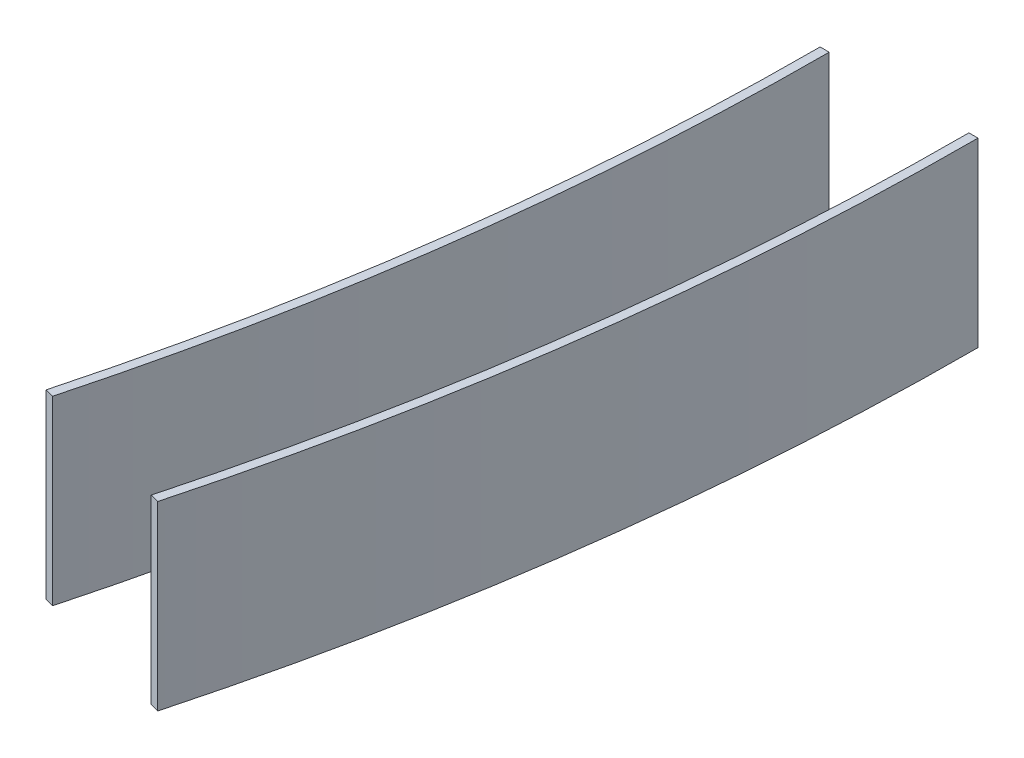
from build123d import *

# Parameters (mm, degrees)
SKETCH_1_W      = 0.5
SKETCH_1_H      = 10
REVOLVE_1_ANGLE = 15


with BuildPart() as part:
    # Sketch 1 → Revolve 1 (revolve)
    with BuildSketch(Plane.XY):
        with Locations((145.9, -4.75)):
            Rectangle(SKETCH_1_W, SKETCH_1_H)
        with Locations((154.1, -4.75)):
            Rectangle(SKETCH_1_W, SKETCH_1_H)
    revolve(axis=Axis((0, 44.11016669, 0), (0, -1, 0)), revolution_arc=REVOLVE_1_ANGLE)


solid = part.part
